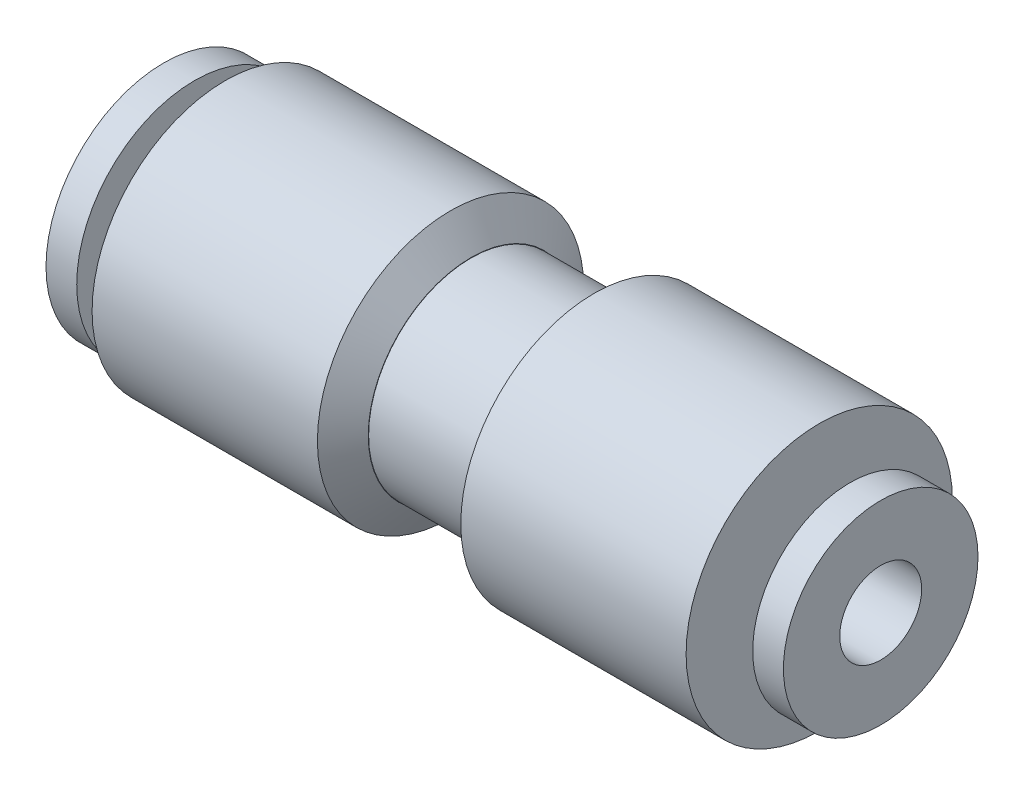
ISO-10303-21;
HEADER;
FILE_DESCRIPTION(('STEP AP214'),'2;1');
FILE_NAME('part.step','',(''),(''),'','','');
FILE_SCHEMA(('AUTOMOTIVE_DESIGN { 1 0 10303 214 1 1 1 1 }'));
ENDSEC;
DATA;
#1=APPLICATION_CONTEXT('core data for automotive mechanical design processes');
#2=APPLICATION_PROTOCOL_DEFINITION('international standard','automotive_design',2000,#1);
#3=PRODUCT_CONTEXT('',#1,'mechanical');
#4=PRODUCT('Part','Part','',(#3));
#5=PRODUCT_RELATED_PRODUCT_CATEGORY('part','',(#4));
#6=PRODUCT_DEFINITION_FORMATION('','',#4);
#7=PRODUCT_DEFINITION_CONTEXT('part definition',#1,'design');
#8=PRODUCT_DEFINITION('design','',#6,#7);
#9=PRODUCT_DEFINITION_SHAPE('','',#8);
#10=(LENGTH_UNIT() NAMED_UNIT(*) SI_UNIT(.MILLI.,.METRE.));
#11=(NAMED_UNIT(*) PLANE_ANGLE_UNIT() SI_UNIT($,.RADIAN.));
#12=(NAMED_UNIT(*) SI_UNIT($,.STERADIAN.) SOLID_ANGLE_UNIT());
#13=UNCERTAINTY_MEASURE_WITH_UNIT(LENGTH_MEASURE(1.E-05),#10,'distance_accuracy_value','');
#14=(GEOMETRIC_REPRESENTATION_CONTEXT(3) GLOBAL_UNCERTAINTY_ASSIGNED_CONTEXT((#13)) GLOBAL_UNIT_ASSIGNED_CONTEXT((#10,
#11,#12)) REPRESENTATION_CONTEXT('',''));
#15=CARTESIAN_POINT('',(0.,0.,0.));
#16=DIRECTION('',(0.,0.,1.));
#17=DIRECTION('',(1.,0.,0.));
#18=AXIS2_PLACEMENT_3D('',#15,#16,#17);
#19=CARTESIAN_POINT('',(0.,0.,0.));
#20=DIRECTION('',(1.,0.,0.));
#21=DIRECTION('',(0.,0.,-1.));
#22=AXIS2_PLACEMENT_3D('',#19,#20,#21);
#23=PLANE('',#22);
#24=CARTESIAN_POINT('',(0.,0.,0.));
#25=DIRECTION('',(1.,0.,0.));
#26=DIRECTION('',(0.,0.,-1.));
#27=AXIS2_PLACEMENT_3D('',#24,#25,#26);
#28=CIRCLE('',#27,6.5);
#29=CARTESIAN_POINT('',(0.,0.,-6.5));
#30=VERTEX_POINT('',#29);
#31=EDGE_CURVE('E52',#30,#30,#28,.T.);
#32=ORIENTED_EDGE('',*,*,#31,.F.);
#33=EDGE_LOOP('',(#32));
#34=FACE_BOUND('',#33,.T.);
#35=CARTESIAN_POINT('',(0.,0.,0.));
#36=DIRECTION('',(1.,0.,0.));
#37=DIRECTION('',(0.,0.,-1.));
#38=AXIS2_PLACEMENT_3D('',#35,#36,#37);
#39=CIRCLE('',#38,3.5);
#40=CARTESIAN_POINT('',(0.,0.,-3.5));
#41=VERTEX_POINT('',#40);
#42=EDGE_CURVE('E49',#41,#41,#39,.F.);
#43=ORIENTED_EDGE('',*,*,#42,.F.);
#44=EDGE_LOOP('',(#43));
#45=FACE_BOUND('',#44,.T.);
#46=ADVANCED_FACE('F29',(#34,#45),#23,.F.);
#47=CARTESIAN_POINT('',(29.,0.,0.));
#48=DIRECTION('',(1.,0.,0.));
#49=DIRECTION('',(0.,0.,-1.));
#50=AXIS2_PLACEMENT_3D('',#47,#48,#49);
#51=PLANE('',#50);
#52=CARTESIAN_POINT('',(29.,0.,0.));
#53=DIRECTION('',(1.,0.,0.));
#54=DIRECTION('',(0.,0.,-1.));
#55=AXIS2_PLACEMENT_3D('',#52,#53,#54);
#56=CIRCLE('',#55,6.5);
#57=CARTESIAN_POINT('',(29.,0.,-6.5));
#58=VERTEX_POINT('',#57);
#59=EDGE_CURVE('E59',#58,#58,#56,.T.);
#60=ORIENTED_EDGE('',*,*,#59,.T.);
#61=EDGE_LOOP('',(#60));
#62=FACE_BOUND('',#61,.T.);
#63=CARTESIAN_POINT('',(29.,0.,0.));
#64=DIRECTION('',(1.,0.,0.));
#65=DIRECTION('',(0.,0.,-1.));
#66=AXIS2_PLACEMENT_3D('',#63,#64,#65);
#67=CIRCLE('',#66,2.5);
#68=CARTESIAN_POINT('',(29.,0.,-2.5));
#69=VERTEX_POINT('',#68);
#70=EDGE_CURVE('E65',#69,#69,#67,.T.);
#71=ORIENTED_EDGE('',*,*,#70,.F.);
#72=EDGE_LOOP('',(#71));
#73=FACE_BOUND('',#72,.T.);
#74=ADVANCED_FACE('F134',(#62,#73),#51,.T.);
#75=CARTESIAN_POINT('',(12.,0.,0.));
#76=DIRECTION('',(1.,0.,0.));
#77=DIRECTION('',(0.,0.,-1.));
#78=AXIS2_PLACEMENT_3D('',#75,#76,#77);
#79=PLANE('',#78);
#80=CARTESIAN_POINT('',(12.,0.,0.));
#81=DIRECTION('',(1.,0.,0.));
#82=DIRECTION('',(0.,0.,-1.));
#83=AXIS2_PLACEMENT_3D('',#80,#81,#82);
#84=CIRCLE('',#83,5.01743903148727);
#85=CARTESIAN_POINT('',(12.,0.,-5.01743903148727));
#86=VERTEX_POINT('',#85);
#87=EDGE_CURVE('E36',#86,#86,#84,.T.);
#88=ORIENTED_EDGE('',*,*,#87,.T.);
#89=EDGE_LOOP('',(#88));
#90=FACE_BOUND('',#89,.T.);
#91=CARTESIAN_POINT('',(12.,0.,0.));
#92=DIRECTION('',(1.,0.,0.));
#93=DIRECTION('',(0.,0.,-1.));
#94=AXIS2_PLACEMENT_3D('',#91,#92,#93);
#95=CIRCLE('',#94,5.);
#96=CARTESIAN_POINT('',(12.,0.,-5.));
#97=VERTEX_POINT('',#96);
#98=EDGE_CURVE('E56',#97,#97,#95,.T.);
#99=ORIENTED_EDGE('',*,*,#98,.F.);
#100=EDGE_LOOP('',(#99));
#101=FACE_BOUND('',#100,.T.);
#102=ADVANCED_FACE('F136',(#90,#101),#79,.T.);
#103=CARTESIAN_POINT('',(12.,0.,0.));
#104=DIRECTION('',(-1.,0.,0.));
#105=DIRECTION('',(0.,0.,1.));
#106=AXIS2_PLACEMENT_3D('',#103,#104,#105);
#107=CYLINDRICAL_SURFACE('',#106,6.5);
#108=CARTESIAN_POINT('',(11.,0.,0.));
#109=DIRECTION('',(1.,0.,0.));
#110=DIRECTION('',(0.,0.,-1.));
#111=AXIS2_PLACEMENT_3D('',#108,#109,#110);
#112=CIRCLE('',#111,6.5);
#113=CARTESIAN_POINT('',(11.,0.,-6.5));
#114=VERTEX_POINT('',#113);
#115=EDGE_CURVE('E10',#114,#114,#112,.F.);
#116=ORIENTED_EDGE('',*,*,#115,.T.);
#117=EDGE_LOOP('',(#116));
#118=FACE_BOUND('',#117,.T.);
#119=ORIENTED_EDGE('',*,*,#31,.T.);
#120=EDGE_LOOP('',(#119));
#121=FACE_BOUND('',#120,.T.);
#122=ADVANCED_FACE('F143',(#118,#121),#107,.T.);
#123=CARTESIAN_POINT('',(17.,0.,0.));
#124=DIRECTION('',(-1.,0.,0.));
#125=DIRECTION('',(0.,0.,1.));
#126=AXIS2_PLACEMENT_3D('',#123,#124,#125);
#127=CYLINDRICAL_SURFACE('',#126,5.);
#128=CARTESIAN_POINT('',(17.,0.,0.));
#129=DIRECTION('',(1.,0.,0.));
#130=DIRECTION('',(0.,0.,-1.));
#131=AXIS2_PLACEMENT_3D('',#128,#129,#130);
#132=CIRCLE('',#131,5.);
#133=CARTESIAN_POINT('',(17.,0.,-5.));
#134=VERTEX_POINT('',#133);
#135=EDGE_CURVE('E55',#134,#134,#132,.T.);
#136=ORIENTED_EDGE('',*,*,#135,.F.);
#137=EDGE_LOOP('',(#136));
#138=FACE_BOUND('',#137,.T.);
#139=ORIENTED_EDGE('',*,*,#98,.T.);
#140=EDGE_LOOP('',(#139));
#141=FACE_BOUND('',#140,.T.);
#142=ADVANCED_FACE('F151',(#138,#141),#127,.T.);
#143=CARTESIAN_POINT('',(17.,0.,0.));
#144=DIRECTION('',(1.,0.,0.));
#145=DIRECTION('',(0.,0.,-1.));
#146=AXIS2_PLACEMENT_3D('',#143,#144,#145);
#147=PLANE('',#146);
#148=CARTESIAN_POINT('',(17.,0.,0.));
#149=DIRECTION('',(1.,0.,0.));
#150=DIRECTION('',(0.,0.,-1.));
#151=AXIS2_PLACEMENT_3D('',#148,#149,#150);
#152=CIRCLE('',#151,5.01743903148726);
#153=CARTESIAN_POINT('',(17.,0.,-5.01743903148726));
#154=VERTEX_POINT('',#153);
#155=EDGE_CURVE('E40',#154,#154,#152,.F.);
#156=ORIENTED_EDGE('',*,*,#155,.T.);
#157=EDGE_LOOP('',(#156));
#158=FACE_BOUND('',#157,.T.);
#159=ORIENTED_EDGE('',*,*,#135,.T.);
#160=EDGE_LOOP('',(#159));
#161=FACE_BOUND('',#160,.T.);
#162=ADVANCED_FACE('F148',(#158,#161),#147,.F.);
#163=CARTESIAN_POINT('',(29.,0.,0.));
#164=DIRECTION('',(-1.,0.,0.));
#165=DIRECTION('',(0.,0.,1.));
#166=AXIS2_PLACEMENT_3D('',#163,#164,#165);
#167=CYLINDRICAL_SURFACE('',#166,6.5);
#168=CARTESIAN_POINT('',(18.,0.,0.));
#169=DIRECTION('',(1.,0.,0.));
#170=DIRECTION('',(0.,0.,-1.));
#171=AXIS2_PLACEMENT_3D('',#168,#169,#170);
#172=CIRCLE('',#171,6.5);
#173=CARTESIAN_POINT('',(18.,0.,-6.5));
#174=VERTEX_POINT('',#173);
#175=EDGE_CURVE('E44',#174,#174,#172,.T.);
#176=ORIENTED_EDGE('',*,*,#175,.T.);
#177=EDGE_LOOP('',(#176));
#178=FACE_BOUND('',#177,.T.);
#179=ORIENTED_EDGE('',*,*,#59,.F.);
#180=EDGE_LOOP('',(#179));
#181=FACE_BOUND('',#180,.T.);
#182=ADVANCED_FACE('F130',(#178,#181),#167,.T.);
#183=CARTESIAN_POINT('',(30.5,0.,0.));
#184=DIRECTION('',(-1.,0.,0.));
#185=DIRECTION('',(0.,0.,1.));
#186=AXIS2_PLACEMENT_3D('',#183,#184,#185);
#187=CYLINDRICAL_SURFACE('',#186,2.5);
#188=CARTESIAN_POINT('',(30.5,0.,0.));
#189=DIRECTION('',(1.,0.,0.));
#190=DIRECTION('',(0.,0.,-1.));
#191=AXIS2_PLACEMENT_3D('',#188,#189,#190);
#192=CIRCLE('',#191,2.5);
#193=CARTESIAN_POINT('',(30.5,0.,-2.5));
#194=VERTEX_POINT('',#193);
#195=EDGE_CURVE('E64',#194,#194,#192,.T.);
#196=ORIENTED_EDGE('',*,*,#195,.F.);
#197=EDGE_LOOP('',(#196));
#198=FACE_BOUND('',#197,.T.);
#199=ORIENTED_EDGE('',*,*,#70,.T.);
#200=EDGE_LOOP('',(#199));
#201=FACE_BOUND('',#200,.T.);
#202=ADVANCED_FACE('F124',(#198,#201),#187,.T.);
#203=CARTESIAN_POINT('',(30.5,0.,0.));
#204=DIRECTION('',(1.,0.,0.));
#205=DIRECTION('',(0.,0.,-1.));
#206=AXIS2_PLACEMENT_3D('',#203,#204,#205);
#207=PLANE('',#206);
#208=CARTESIAN_POINT('',(30.5,0.,0.));
#209=DIRECTION('',(1.,0.,0.));
#210=DIRECTION('',(0.,0.,-1.));
#211=AXIS2_PLACEMENT_3D('',#208,#209,#210);
#212=CIRCLE('',#211,4.75);
#213=CARTESIAN_POINT('',(30.5,0.,-4.75));
#214=VERTEX_POINT('',#213);
#215=EDGE_CURVE('E71',#214,#214,#212,.T.);
#216=ORIENTED_EDGE('',*,*,#215,.F.);
#217=EDGE_LOOP('',(#216));
#218=FACE_BOUND('',#217,.T.);
#219=ORIENTED_EDGE('',*,*,#195,.T.);
#220=EDGE_LOOP('',(#219));
#221=FACE_BOUND('',#220,.T.);
#222=ADVANCED_FACE('F118',(#218,#221),#207,.F.);
#223=CARTESIAN_POINT('',(32.,0.,0.));
#224=DIRECTION('',(-1.,0.,0.));
#225=DIRECTION('',(0.,0.,1.));
#226=AXIS2_PLACEMENT_3D('',#223,#224,#225);
#227=CYLINDRICAL_SURFACE('',#226,4.75);
#228=CARTESIAN_POINT('',(32.,0.,0.));
#229=DIRECTION('',(1.,0.,0.));
#230=DIRECTION('',(0.,0.,-1.));
#231=AXIS2_PLACEMENT_3D('',#228,#229,#230);
#232=CIRCLE('',#231,4.75);
#233=CARTESIAN_POINT('',(32.,0.,-4.75));
#234=VERTEX_POINT('',#233);
#235=EDGE_CURVE('E68',#234,#234,#232,.T.);
#236=ORIENTED_EDGE('',*,*,#235,.F.);
#237=EDGE_LOOP('',(#236));
#238=FACE_BOUND('',#237,.T.);
#239=ORIENTED_EDGE('',*,*,#215,.T.);
#240=EDGE_LOOP('',(#239));
#241=FACE_BOUND('',#240,.T.);
#242=ADVANCED_FACE('F112',(#238,#241),#227,.T.);
#243=CARTESIAN_POINT('',(32.,0.,0.));
#244=DIRECTION('',(1.,0.,0.));
#245=DIRECTION('',(0.,0.,-1.));
#246=AXIS2_PLACEMENT_3D('',#243,#244,#245);
#247=PLANE('',#246);
#248=CARTESIAN_POINT('',(32.,0.,0.));
#249=DIRECTION('',(1.,0.,0.));
#250=DIRECTION('',(0.,0.,-1.));
#251=AXIS2_PLACEMENT_3D('',#248,#249,#250);
#252=CIRCLE('',#251,2.);
#253=CARTESIAN_POINT('',(32.,0.,-2.));
#254=VERTEX_POINT('',#253);
#255=EDGE_CURVE('E92',#254,#254,#252,.T.);
#256=ORIENTED_EDGE('',*,*,#255,.F.);
#257=EDGE_LOOP('',(#256));
#258=FACE_BOUND('',#257,.T.);
#259=ORIENTED_EDGE('',*,*,#235,.T.);
#260=EDGE_LOOP('',(#259));
#261=FACE_BOUND('',#260,.T.);
#262=ADVANCED_FACE('F108',(#258,#261),#247,.T.);
#263=CARTESIAN_POINT('',(-1.5,0.,0.));
#264=DIRECTION('',(1.,0.,0.));
#265=DIRECTION('',(0.,0.,-1.));
#266=AXIS2_PLACEMENT_3D('',#263,#264,#265);
#267=CYLINDRICAL_SURFACE('',#266,3.5);
#268=CARTESIAN_POINT('',(-1.5,0.,0.));
#269=DIRECTION('',(-1.,0.,0.));
#270=DIRECTION('',(0.,0.,1.));
#271=AXIS2_PLACEMENT_3D('',#268,#269,#270);
#272=CIRCLE('',#271,3.5);
#273=CARTESIAN_POINT('',(-1.5,0.,3.5));
#274=VERTEX_POINT('',#273);
#275=EDGE_CURVE('E74',#274,#274,#272,.T.);
#276=ORIENTED_EDGE('',*,*,#275,.F.);
#277=EDGE_LOOP('',(#276));
#278=FACE_BOUND('',#277,.T.);
#279=ORIENTED_EDGE('',*,*,#42,.T.);
#280=EDGE_LOOP('',(#279));
#281=FACE_BOUND('',#280,.T.);
#282=ADVANCED_FACE('F111',(#278,#281),#267,.T.);
#283=CARTESIAN_POINT('',(-1.5,0.,0.));
#284=DIRECTION('',(-1.,0.,0.));
#285=DIRECTION('',(0.,0.,1.));
#286=AXIS2_PLACEMENT_3D('',#283,#284,#285);
#287=PLANE('',#286);
#288=CARTESIAN_POINT('',(-1.5,0.,0.));
#289=DIRECTION('',(-1.,0.,0.));
#290=DIRECTION('',(0.,0.,1.));
#291=AXIS2_PLACEMENT_3D('',#288,#289,#290);
#292=CIRCLE('',#291,5.75);
#293=CARTESIAN_POINT('',(-1.5,0.,5.75));
#294=VERTEX_POINT('',#293);
#295=EDGE_CURVE('E80',#294,#294,#292,.T.);
#296=ORIENTED_EDGE('',*,*,#295,.F.);
#297=EDGE_LOOP('',(#296));
#298=FACE_BOUND('',#297,.T.);
#299=ORIENTED_EDGE('',*,*,#275,.T.);
#300=EDGE_LOOP('',(#299));
#301=FACE_BOUND('',#300,.T.);
#302=ADVANCED_FACE('F262',(#298,#301),#287,.F.);
#303=CARTESIAN_POINT('',(-3.,0.,0.));
#304=DIRECTION('',(1.,0.,0.));
#305=DIRECTION('',(0.,0.,-1.));
#306=AXIS2_PLACEMENT_3D('',#303,#304,#305);
#307=CYLINDRICAL_SURFACE('',#306,5.75);
#308=CARTESIAN_POINT('',(-3.,0.,0.));
#309=DIRECTION('',(-1.,0.,0.));
#310=DIRECTION('',(0.,0.,1.));
#311=AXIS2_PLACEMENT_3D('',#308,#309,#310);
#312=CIRCLE('',#311,5.75);
#313=CARTESIAN_POINT('',(-3.,0.,5.75));
#314=VERTEX_POINT('',#313);
#315=EDGE_CURVE('E79',#314,#314,#312,.T.);
#316=ORIENTED_EDGE('',*,*,#315,.F.);
#317=EDGE_LOOP('',(#316));
#318=FACE_BOUND('',#317,.T.);
#319=ORIENTED_EDGE('',*,*,#295,.T.);
#320=EDGE_LOOP('',(#319));
#321=FACE_BOUND('',#320,.T.);
#322=ADVANCED_FACE('F252',(#318,#321),#307,.T.);
#323=CARTESIAN_POINT('',(-3.,0.,0.));
#324=DIRECTION('',(-1.,0.,0.));
#325=DIRECTION('',(0.,0.,1.));
#326=AXIS2_PLACEMENT_3D('',#323,#324,#325);
#327=PLANE('',#326);
#328=CARTESIAN_POINT('',(-3.,0.,0.));
#329=DIRECTION('',(-1.,0.,0.));
#330=DIRECTION('',(0.,0.,1.));
#331=AXIS2_PLACEMENT_3D('',#328,#329,#330);
#332=CIRCLE('',#331,3.);
#333=CARTESIAN_POINT('',(-3.,0.,3.));
#334=VERTEX_POINT('',#333);
#335=EDGE_CURVE('E86',#334,#334,#332,.T.);
#336=ORIENTED_EDGE('',*,*,#335,.F.);
#337=EDGE_LOOP('',(#336));
#338=FACE_BOUND('',#337,.T.);
#339=ORIENTED_EDGE('',*,*,#315,.T.);
#340=EDGE_LOOP('',(#339));
#341=FACE_BOUND('',#340,.T.);
#342=ADVANCED_FACE('F242',(#338,#341),#327,.T.);
#343=CARTESIAN_POINT('',(14.5,0.,0.));
#344=DIRECTION('',(-1.,0.,0.));
#345=DIRECTION('',(0.,0.,1.));
#346=AXIS2_PLACEMENT_3D('',#343,#344,#345);
#347=CYLINDRICAL_SURFACE('',#346,3.);
#348=CARTESIAN_POINT('',(14.5,0.,0.));
#349=DIRECTION('',(-1.,0.,0.));
#350=DIRECTION('',(0.,0.,1.));
#351=AXIS2_PLACEMENT_3D('',#348,#349,#350);
#352=CIRCLE('',#351,3.);
#353=CARTESIAN_POINT('',(14.5,0.,3.));
#354=VERTEX_POINT('',#353);
#355=EDGE_CURVE('E83',#354,#354,#352,.T.);
#356=ORIENTED_EDGE('',*,*,#355,.F.);
#357=EDGE_LOOP('',(#356));
#358=FACE_BOUND('',#357,.T.);
#359=ORIENTED_EDGE('',*,*,#335,.T.);
#360=EDGE_LOOP('',(#359));
#361=FACE_BOUND('',#360,.T.);
#362=ADVANCED_FACE('F224',(#358,#361),#347,.F.);
#363=CARTESIAN_POINT('',(14.5,0.,0.));
#364=DIRECTION('',(-1.,0.,0.));
#365=DIRECTION('',(0.,0.,1.));
#366=AXIS2_PLACEMENT_3D('',#363,#364,#365);
#367=PLANE('',#366);
#368=CARTESIAN_POINT('',(14.5,0.,0.));
#369=DIRECTION('',(1.,0.,0.));
#370=DIRECTION('',(0.,0.,-1.));
#371=AXIS2_PLACEMENT_3D('',#368,#369,#370);
#372=CIRCLE('',#371,2.);
#373=CARTESIAN_POINT('',(14.5,0.,-2.));
#374=VERTEX_POINT('',#373);
#375=EDGE_CURVE('E89',#374,#374,#372,.T.);
#376=ORIENTED_EDGE('',*,*,#375,.T.);
#377=EDGE_LOOP('',(#376));
#378=FACE_BOUND('',#377,.T.);
#379=ORIENTED_EDGE('',*,*,#355,.T.);
#380=EDGE_LOOP('',(#379));
#381=FACE_BOUND('',#380,.T.);
#382=ADVANCED_FACE('F98',(#378,#381),#367,.T.);
#383=CARTESIAN_POINT('',(14.5,0.,0.));
#384=DIRECTION('',(1.,0.,0.));
#385=DIRECTION('',(0.,0.,-1.));
#386=AXIS2_PLACEMENT_3D('',#383,#384,#385);
#387=CYLINDRICAL_SURFACE('',#386,2.);
#388=ORIENTED_EDGE('',*,*,#375,.F.);
#389=EDGE_LOOP('',(#388));
#390=FACE_BOUND('',#389,.T.);
#391=ORIENTED_EDGE('',*,*,#255,.T.);
#392=EDGE_LOOP('',(#391));
#393=FACE_BOUND('',#392,.T.);
#394=ADVANCED_FACE('F101',(#390,#393),#387,.F.);
#395=CARTESIAN_POINT('',(18.,0.,0.));
#396=DIRECTION('',(1.,0.,0.));
#397=DIRECTION('',(0.,0.,-1.));
#398=AXIS2_PLACEMENT_3D('',#395,#396,#397);
#399=CONICAL_SURFACE('',#398,6.5,0.977384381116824);
#400=ORIENTED_EDGE('',*,*,#155,.F.);
#401=EDGE_LOOP('',(#400));
#402=FACE_BOUND('',#401,.T.);
#403=ORIENTED_EDGE('',*,*,#175,.F.);
#404=EDGE_LOOP('',(#403));
#405=FACE_BOUND('',#404,.T.);
#406=ADVANCED_FACE('F104',(#402,#405),#399,.T.);
#407=CARTESIAN_POINT('',(12.,0.,0.));
#408=DIRECTION('',(-1.,0.,0.));
#409=DIRECTION('',(0.,0.,1.));
#410=AXIS2_PLACEMENT_3D('',#407,#408,#409);
#411=CONICAL_SURFACE('',#410,5.01743903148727,0.977384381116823);
#412=ORIENTED_EDGE('',*,*,#115,.F.);
#413=EDGE_LOOP('',(#412));
#414=FACE_BOUND('',#413,.T.);
#415=ORIENTED_EDGE('',*,*,#87,.F.);
#416=EDGE_LOOP('',(#415));
#417=FACE_BOUND('',#416,.T.);
#418=ADVANCED_FACE('F31',(#414,#417),#411,.T.);
#419=CLOSED_SHELL('',(#46,#74,#102,#122,#142,#162,#182,#202,#222,#242,#262,#282,#302,#322,#342,
#362,#382,#394,#406,#418));
#420=MANIFOLD_SOLID_BREP('B2',#419);
#421=ADVANCED_BREP_SHAPE_REPRESENTATION('',(#18,#420),#14);
#422=SHAPE_DEFINITION_REPRESENTATION(#9,#421);
ENDSEC;
END-ISO-10303-21;
